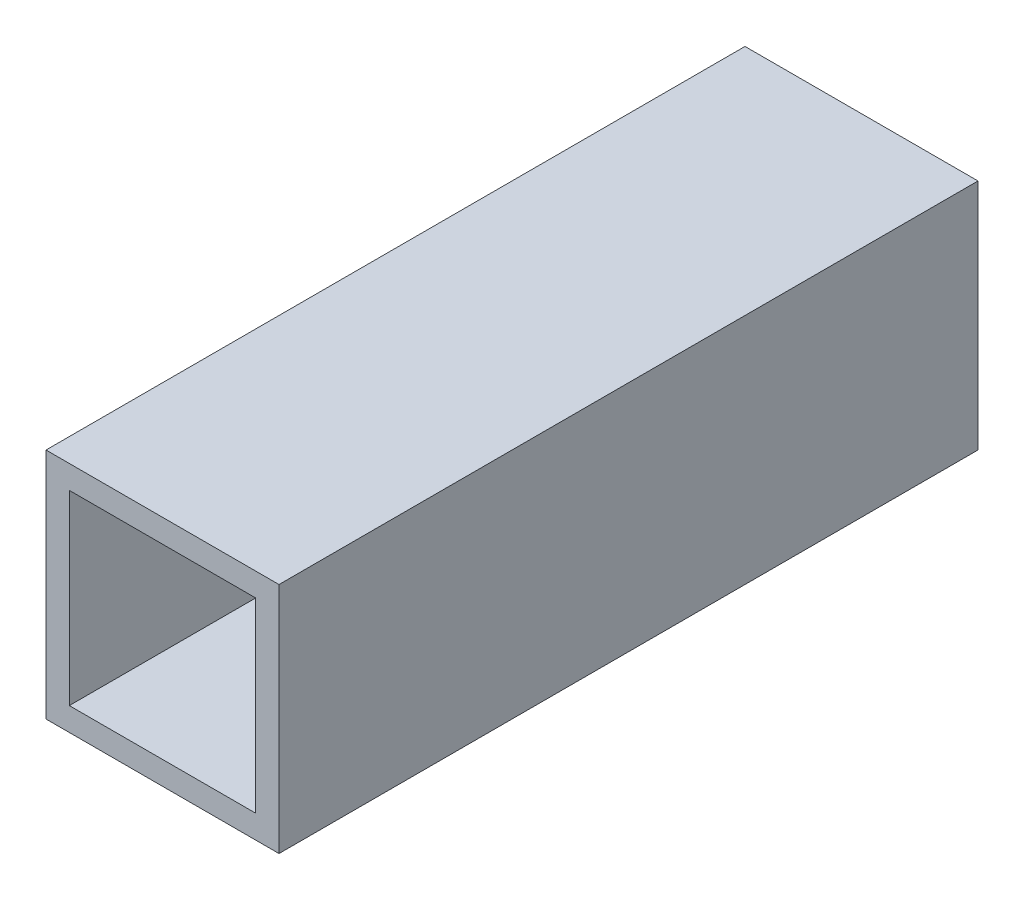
ISO-10303-21;
HEADER;
FILE_DESCRIPTION(('STEP AP214'),'2;1');
FILE_NAME('part.step','',(''),(''),'','','');
FILE_SCHEMA(('AUTOMOTIVE_DESIGN { 1 0 10303 214 1 1 1 1 }'));
ENDSEC;
DATA;
#1=APPLICATION_CONTEXT('core data for automotive mechanical design processes');
#2=APPLICATION_PROTOCOL_DEFINITION('international standard','automotive_design',2000,#1);
#3=PRODUCT_CONTEXT('',#1,'mechanical');
#4=PRODUCT('Part','Part','',(#3));
#5=PRODUCT_RELATED_PRODUCT_CATEGORY('part','',(#4));
#6=PRODUCT_DEFINITION_FORMATION('','',#4);
#7=PRODUCT_DEFINITION_CONTEXT('part definition',#1,'design');
#8=PRODUCT_DEFINITION('design','',#6,#7);
#9=PRODUCT_DEFINITION_SHAPE('','',#8);
#10=(LENGTH_UNIT() NAMED_UNIT(*) SI_UNIT(.MILLI.,.METRE.));
#11=(NAMED_UNIT(*) PLANE_ANGLE_UNIT() SI_UNIT($,.RADIAN.));
#12=(NAMED_UNIT(*) SI_UNIT($,.STERADIAN.) SOLID_ANGLE_UNIT());
#13=UNCERTAINTY_MEASURE_WITH_UNIT(LENGTH_MEASURE(1.E-05),#10,'distance_accuracy_value','');
#14=(GEOMETRIC_REPRESENTATION_CONTEXT(3) GLOBAL_UNCERTAINTY_ASSIGNED_CONTEXT((#13)) GLOBAL_UNIT_ASSIGNED_CONTEXT((#10,
#11,#12)) REPRESENTATION_CONTEXT('',''));
#15=CARTESIAN_POINT('',(0.,0.,0.));
#16=DIRECTION('',(0.,0.,1.));
#17=DIRECTION('',(1.,0.,0.));
#18=AXIS2_PLACEMENT_3D('',#15,#16,#17);
#19=CARTESIAN_POINT('',(0.,0.,300.));
#20=DIRECTION('',(0.,0.,1.));
#21=DIRECTION('',(1.,0.,0.));
#22=AXIS2_PLACEMENT_3D('',#19,#20,#21);
#23=PLANE('',#22);
#24=DIRECTION('',(0.,-1.,0.));
#25=VECTOR('',#24,1.);
#26=CARTESIAN_POINT('',(-40.,40.,300.));
#27=LINE('',#26,#25);
#28=CARTESIAN_POINT('',(-40.,40.,300.));
#29=VERTEX_POINT('',#28);
#30=CARTESIAN_POINT('',(-40.,-40.,300.));
#31=VERTEX_POINT('',#30);
#32=EDGE_CURVE('E25',#29,#31,#27,.T.);
#33=ORIENTED_EDGE('',*,*,#32,.F.);
#34=DIRECTION('',(-1.,0.,0.));
#35=VECTOR('',#34,1.);
#36=CARTESIAN_POINT('',(40.,40.,300.));
#37=LINE('',#36,#35);
#38=CARTESIAN_POINT('',(40.,40.,300.));
#39=VERTEX_POINT('',#38);
#40=EDGE_CURVE('E63',#39,#29,#37,.T.);
#41=ORIENTED_EDGE('',*,*,#40,.F.);
#42=DIRECTION('',(0.,1.,0.));
#43=VECTOR('',#42,1.);
#44=CARTESIAN_POINT('',(40.,-40.,300.));
#45=LINE('',#44,#43);
#46=CARTESIAN_POINT('',(40.,-40.,300.));
#47=VERTEX_POINT('',#46);
#48=EDGE_CURVE('E143',#47,#39,#45,.T.);
#49=ORIENTED_EDGE('',*,*,#48,.F.);
#50=DIRECTION('',(1.,0.,0.));
#51=VECTOR('',#50,1.);
#52=CARTESIAN_POINT('',(-40.,-40.,300.));
#53=LINE('',#52,#51);
#54=EDGE_CURVE('E167',#31,#47,#53,.T.);
#55=ORIENTED_EDGE('',*,*,#54,.F.);
#56=EDGE_LOOP('',(#33,#41,#49,#55));
#57=FACE_BOUND('',#56,.T.);
#58=DIRECTION('',(1.,0.,0.));
#59=VECTOR('',#58,1.);
#60=CARTESIAN_POINT('',(-50.,-50.,300.));
#61=LINE('',#60,#59);
#62=CARTESIAN_POINT('',(-50.,-50.,300.));
#63=VERTEX_POINT('',#62);
#64=CARTESIAN_POINT('',(50.,-50.,300.));
#65=VERTEX_POINT('',#64);
#66=EDGE_CURVE('E184',#63,#65,#61,.T.);
#67=ORIENTED_EDGE('',*,*,#66,.T.);
#68=DIRECTION('',(0.,1.,0.));
#69=VECTOR('',#68,1.);
#70=CARTESIAN_POINT('',(50.,-50.,300.));
#71=LINE('',#70,#69);
#72=CARTESIAN_POINT('',(50.,50.,300.));
#73=VERTEX_POINT('',#72);
#74=EDGE_CURVE('E124',#65,#73,#71,.T.);
#75=ORIENTED_EDGE('',*,*,#74,.T.);
#76=DIRECTION('',(-1.,0.,0.));
#77=VECTOR('',#76,1.);
#78=CARTESIAN_POINT('',(50.,50.,300.));
#79=LINE('',#78,#77);
#80=CARTESIAN_POINT('',(-50.,50.,300.));
#81=VERTEX_POINT('',#80);
#82=EDGE_CURVE('E123',#73,#81,#79,.T.);
#83=ORIENTED_EDGE('',*,*,#82,.T.);
#84=DIRECTION('',(0.,-1.,0.));
#85=VECTOR('',#84,1.);
#86=CARTESIAN_POINT('',(-50.,50.,300.));
#87=LINE('',#86,#85);
#88=EDGE_CURVE('E108',#81,#63,#87,.T.);
#89=ORIENTED_EDGE('',*,*,#88,.T.);
#90=EDGE_LOOP('',(#67,#75,#83,#89));
#91=FACE_BOUND('',#90,.T.);
#92=ADVANCED_FACE('F16',(#57,#91),#23,.T.);
#93=CARTESIAN_POINT('',(0.,0.,0.));
#94=DIRECTION('',(0.,0.,1.));
#95=DIRECTION('',(1.,0.,0.));
#96=AXIS2_PLACEMENT_3D('',#93,#94,#95);
#97=PLANE('',#96);
#98=DIRECTION('',(1.,0.,0.));
#99=VECTOR('',#98,1.);
#100=CARTESIAN_POINT('',(-40.,-40.,0.));
#101=LINE('',#100,#99);
#102=CARTESIAN_POINT('',(-40.,-40.,0.));
#103=VERTEX_POINT('',#102);
#104=CARTESIAN_POINT('',(40.,-40.,0.));
#105=VERTEX_POINT('',#104);
#106=EDGE_CURVE('E140',#103,#105,#101,.T.);
#107=ORIENTED_EDGE('',*,*,#106,.T.);
#108=DIRECTION('',(0.,1.,0.));
#109=VECTOR('',#108,1.);
#110=CARTESIAN_POINT('',(40.,-40.,0.));
#111=LINE('',#110,#109);
#112=CARTESIAN_POINT('',(40.,40.,0.));
#113=VERTEX_POINT('',#112);
#114=EDGE_CURVE('E151',#105,#113,#111,.T.);
#115=ORIENTED_EDGE('',*,*,#114,.T.);
#116=DIRECTION('',(-1.,0.,0.));
#117=VECTOR('',#116,1.);
#118=CARTESIAN_POINT('',(40.,40.,0.));
#119=LINE('',#118,#117);
#120=CARTESIAN_POINT('',(-40.,40.,0.));
#121=VERTEX_POINT('',#120);
#122=EDGE_CURVE('E51',#113,#121,#119,.T.);
#123=ORIENTED_EDGE('',*,*,#122,.T.);
#124=DIRECTION('',(0.,-1.,0.));
#125=VECTOR('',#124,1.);
#126=CARTESIAN_POINT('',(-40.,40.,0.));
#127=LINE('',#126,#125);
#128=EDGE_CURVE('E10',#121,#103,#127,.T.);
#129=ORIENTED_EDGE('',*,*,#128,.T.);
#130=EDGE_LOOP('',(#107,#115,#123,#129));
#131=FACE_BOUND('',#130,.T.);
#132=DIRECTION('',(0.,-1.,0.));
#133=VECTOR('',#132,1.);
#134=CARTESIAN_POINT('',(-50.,50.,0.));
#135=LINE('',#134,#133);
#136=CARTESIAN_POINT('',(-50.,50.,0.));
#137=VERTEX_POINT('',#136);
#138=CARTESIAN_POINT('',(-50.,-50.,0.));
#139=VERTEX_POINT('',#138);
#140=EDGE_CURVE('E102',#137,#139,#135,.T.);
#141=ORIENTED_EDGE('',*,*,#140,.F.);
#142=DIRECTION('',(-1.,0.,0.));
#143=VECTOR('',#142,1.);
#144=CARTESIAN_POINT('',(50.,50.,0.));
#145=LINE('',#144,#143);
#146=CARTESIAN_POINT('',(50.,50.,0.));
#147=VERTEX_POINT('',#146);
#148=EDGE_CURVE('E131',#147,#137,#145,.T.);
#149=ORIENTED_EDGE('',*,*,#148,.F.);
#150=DIRECTION('',(0.,1.,0.));
#151=VECTOR('',#150,1.);
#152=CARTESIAN_POINT('',(50.,-50.,0.));
#153=LINE('',#152,#151);
#154=CARTESIAN_POINT('',(50.,-50.,0.));
#155=VERTEX_POINT('',#154);
#156=EDGE_CURVE('E188',#155,#147,#153,.T.);
#157=ORIENTED_EDGE('',*,*,#156,.F.);
#158=DIRECTION('',(1.,0.,0.));
#159=VECTOR('',#158,1.);
#160=CARTESIAN_POINT('',(-50.,-50.,0.));
#161=LINE('',#160,#159);
#162=EDGE_CURVE('E292',#139,#155,#161,.T.);
#163=ORIENTED_EDGE('',*,*,#162,.F.);
#164=EDGE_LOOP('',(#141,#149,#157,#163));
#165=FACE_BOUND('',#164,.T.);
#166=ADVANCED_FACE('F202',(#131,#165),#97,.F.);
#167=CARTESIAN_POINT('',(-40.,40.,0.));
#168=DIRECTION('',(1.,0.,0.));
#169=DIRECTION('',(0.,1.,0.));
#170=AXIS2_PLACEMENT_3D('',#167,#168,#169);
#171=PLANE('',#170);
#172=DIRECTION('',(0.,0.,1.));
#173=VECTOR('',#172,1.);
#174=CARTESIAN_POINT('',(-40.,40.,0.));
#175=LINE('',#174,#173);
#176=EDGE_CURVE('E156',#121,#29,#175,.T.);
#177=ORIENTED_EDGE('',*,*,#176,.T.);
#178=ORIENTED_EDGE('',*,*,#32,.T.);
#179=DIRECTION('',(0.,0.,1.));
#180=VECTOR('',#179,1.);
#181=CARTESIAN_POINT('',(-40.,-40.,0.));
#182=LINE('',#181,#180);
#183=EDGE_CURVE('E120',#103,#31,#182,.T.);
#184=ORIENTED_EDGE('',*,*,#183,.F.);
#185=ORIENTED_EDGE('',*,*,#128,.F.);
#186=EDGE_LOOP('',(#177,#178,#184,#185));
#187=FACE_BOUND('',#186,.T.);
#188=ADVANCED_FACE('F164',(#187),#171,.T.);
#189=CARTESIAN_POINT('',(40.,40.,0.));
#190=DIRECTION('',(0.,-1.,0.));
#191=DIRECTION('',(0.,0.,-1.));
#192=AXIS2_PLACEMENT_3D('',#189,#190,#191);
#193=PLANE('',#192);
#194=DIRECTION('',(0.,0.,1.));
#195=VECTOR('',#194,1.);
#196=CARTESIAN_POINT('',(40.,40.,0.));
#197=LINE('',#196,#195);
#198=EDGE_CURVE('E148',#113,#39,#197,.T.);
#199=ORIENTED_EDGE('',*,*,#198,.T.);
#200=ORIENTED_EDGE('',*,*,#40,.T.);
#201=ORIENTED_EDGE('',*,*,#176,.F.);
#202=ORIENTED_EDGE('',*,*,#122,.F.);
#203=EDGE_LOOP('',(#199,#200,#201,#202));
#204=FACE_BOUND('',#203,.T.);
#205=ADVANCED_FACE('F203',(#204),#193,.T.);
#206=CARTESIAN_POINT('',(40.,-40.,0.));
#207=DIRECTION('',(-1.,0.,0.));
#208=DIRECTION('',(0.,0.,1.));
#209=AXIS2_PLACEMENT_3D('',#206,#207,#208);
#210=PLANE('',#209);
#211=DIRECTION('',(0.,0.,1.));
#212=VECTOR('',#211,1.);
#213=CARTESIAN_POINT('',(40.,-40.,0.));
#214=LINE('',#213,#212);
#215=EDGE_CURVE('E144',#105,#47,#214,.T.);
#216=ORIENTED_EDGE('',*,*,#215,.T.);
#217=ORIENTED_EDGE('',*,*,#48,.T.);
#218=ORIENTED_EDGE('',*,*,#198,.F.);
#219=ORIENTED_EDGE('',*,*,#114,.F.);
#220=EDGE_LOOP('',(#216,#217,#218,#219));
#221=FACE_BOUND('',#220,.T.);
#222=ADVANCED_FACE('F199',(#221),#210,.T.);
#223=CARTESIAN_POINT('',(-40.,-40.,0.));
#224=DIRECTION('',(0.,1.,0.));
#225=DIRECTION('',(1.,0.,0.));
#226=AXIS2_PLACEMENT_3D('',#223,#224,#225);
#227=PLANE('',#226);
#228=ORIENTED_EDGE('',*,*,#183,.T.);
#229=ORIENTED_EDGE('',*,*,#54,.T.);
#230=ORIENTED_EDGE('',*,*,#215,.F.);
#231=ORIENTED_EDGE('',*,*,#106,.F.);
#232=EDGE_LOOP('',(#228,#229,#230,#231));
#233=FACE_BOUND('',#232,.T.);
#234=ADVANCED_FACE('F174',(#233),#227,.T.);
#235=CARTESIAN_POINT('',(-50.,50.,0.));
#236=DIRECTION('',(1.,0.,0.));
#237=DIRECTION('',(0.,1.,0.));
#238=AXIS2_PLACEMENT_3D('',#235,#236,#237);
#239=PLANE('',#238);
#240=ORIENTED_EDGE('',*,*,#140,.T.);
#241=DIRECTION('',(0.,0.,1.));
#242=VECTOR('',#241,1.);
#243=CARTESIAN_POINT('',(-50.,-50.,0.));
#244=LINE('',#243,#242);
#245=EDGE_CURVE('E115',#139,#63,#244,.T.);
#246=ORIENTED_EDGE('',*,*,#245,.T.);
#247=ORIENTED_EDGE('',*,*,#88,.F.);
#248=DIRECTION('',(0.,0.,1.));
#249=VECTOR('',#248,1.);
#250=CARTESIAN_POINT('',(-50.,50.,0.));
#251=LINE('',#250,#249);
#252=EDGE_CURVE('E112',#137,#81,#251,.T.);
#253=ORIENTED_EDGE('',*,*,#252,.F.);
#254=EDGE_LOOP('',(#240,#246,#247,#253));
#255=FACE_BOUND('',#254,.T.);
#256=ADVANCED_FACE('F110',(#255),#239,.F.);
#257=CARTESIAN_POINT('',(50.,50.,0.));
#258=DIRECTION('',(0.,-1.,0.));
#259=DIRECTION('',(0.,0.,-1.));
#260=AXIS2_PLACEMENT_3D('',#257,#258,#259);
#261=PLANE('',#260);
#262=ORIENTED_EDGE('',*,*,#148,.T.);
#263=ORIENTED_EDGE('',*,*,#252,.T.);
#264=ORIENTED_EDGE('',*,*,#82,.F.);
#265=DIRECTION('',(0.,0.,1.));
#266=VECTOR('',#265,1.);
#267=CARTESIAN_POINT('',(50.,50.,0.));
#268=LINE('',#267,#266);
#269=EDGE_CURVE('E192',#147,#73,#268,.T.);
#270=ORIENTED_EDGE('',*,*,#269,.F.);
#271=EDGE_LOOP('',(#262,#263,#264,#270));
#272=FACE_BOUND('',#271,.T.);
#273=ADVANCED_FACE('F130',(#272),#261,.F.);
#274=CARTESIAN_POINT('',(50.,-50.,0.));
#275=DIRECTION('',(-1.,0.,0.));
#276=DIRECTION('',(0.,0.,1.));
#277=AXIS2_PLACEMENT_3D('',#274,#275,#276);
#278=PLANE('',#277);
#279=ORIENTED_EDGE('',*,*,#156,.T.);
#280=ORIENTED_EDGE('',*,*,#269,.T.);
#281=ORIENTED_EDGE('',*,*,#74,.F.);
#282=DIRECTION('',(0.,0.,1.));
#283=VECTOR('',#282,1.);
#284=CARTESIAN_POINT('',(50.,-50.,0.));
#285=LINE('',#284,#283);
#286=EDGE_CURVE('E182',#155,#65,#285,.T.);
#287=ORIENTED_EDGE('',*,*,#286,.F.);
#288=EDGE_LOOP('',(#279,#280,#281,#287));
#289=FACE_BOUND('',#288,.T.);
#290=ADVANCED_FACE('F265',(#289),#278,.F.);
#291=CARTESIAN_POINT('',(-50.,-50.,0.));
#292=DIRECTION('',(0.,1.,0.));
#293=DIRECTION('',(1.,0.,0.));
#294=AXIS2_PLACEMENT_3D('',#291,#292,#293);
#295=PLANE('',#294);
#296=ORIENTED_EDGE('',*,*,#162,.T.);
#297=ORIENTED_EDGE('',*,*,#286,.T.);
#298=ORIENTED_EDGE('',*,*,#66,.F.);
#299=ORIENTED_EDGE('',*,*,#245,.F.);
#300=EDGE_LOOP('',(#296,#297,#298,#299));
#301=FACE_BOUND('',#300,.T.);
#302=ADVANCED_FACE('F274',(#301),#295,.F.);
#303=CLOSED_SHELL('',(#92,#166,#188,#205,#222,#234,#256,#273,#290,#302));
#304=MANIFOLD_SOLID_BREP('B1',#303);
#305=ADVANCED_BREP_SHAPE_REPRESENTATION('',(#18,#304),#14);
#306=SHAPE_DEFINITION_REPRESENTATION(#9,#305);
ENDSEC;
END-ISO-10303-21;
